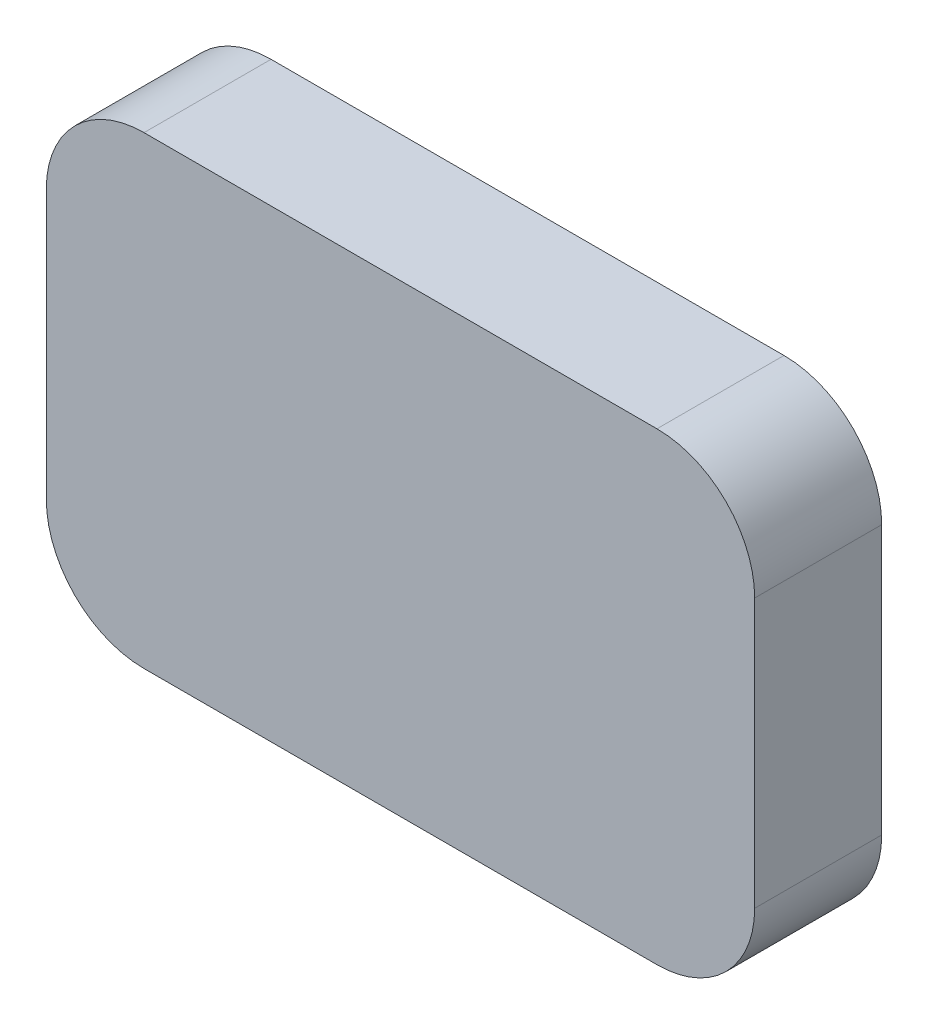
ISO-10303-21;
HEADER;
FILE_DESCRIPTION(('STEP AP214'),'2;1');
FILE_NAME('part.step','',(''),(''),'','','');
FILE_SCHEMA(('AUTOMOTIVE_DESIGN { 1 0 10303 214 1 1 1 1 }'));
ENDSEC;
DATA;
#1=APPLICATION_CONTEXT('core data for automotive mechanical design processes');
#2=APPLICATION_PROTOCOL_DEFINITION('international standard','automotive_design',2000,#1);
#3=PRODUCT_CONTEXT('',#1,'mechanical');
#4=PRODUCT('Part','Part','',(#3));
#5=PRODUCT_RELATED_PRODUCT_CATEGORY('part','',(#4));
#6=PRODUCT_DEFINITION_FORMATION('','',#4);
#7=PRODUCT_DEFINITION_CONTEXT('part definition',#1,'design');
#8=PRODUCT_DEFINITION('design','',#6,#7);
#9=PRODUCT_DEFINITION_SHAPE('','',#8);
#10=(LENGTH_UNIT() NAMED_UNIT(*) SI_UNIT(.MILLI.,.METRE.));
#11=(NAMED_UNIT(*) PLANE_ANGLE_UNIT() SI_UNIT($,.RADIAN.));
#12=(NAMED_UNIT(*) SI_UNIT($,.STERADIAN.) SOLID_ANGLE_UNIT());
#13=UNCERTAINTY_MEASURE_WITH_UNIT(LENGTH_MEASURE(1.E-05),#10,'distance_accuracy_value','');
#14=(GEOMETRIC_REPRESENTATION_CONTEXT(3) GLOBAL_UNCERTAINTY_ASSIGNED_CONTEXT((#13)) GLOBAL_UNIT_ASSIGNED_CONTEXT((#10,
#11,#12)) REPRESENTATION_CONTEXT('',''));
#15=CARTESIAN_POINT('',(0.,0.,0.));
#16=DIRECTION('',(0.,0.,1.));
#17=DIRECTION('',(1.,0.,0.));
#18=AXIS2_PLACEMENT_3D('',#15,#16,#17);
#19=CARTESIAN_POINT('',(20.,75.,26.));
#20=DIRECTION('',(0.,0.,-1.));
#21=DIRECTION('',(-1.,0.,0.));
#22=AXIS2_PLACEMENT_3D('',#19,#20,#21);
#23=CYLINDRICAL_SURFACE('',#22,20.);
#24=CARTESIAN_POINT('',(20.,75.,0.));
#25=DIRECTION('',(0.,0.,1.));
#26=DIRECTION('',(-1.,0.,0.));
#27=AXIS2_PLACEMENT_3D('',#24,#25,#26);
#28=CIRCLE('',#27,20.);
#29=CARTESIAN_POINT('',(20.0000000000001,95.,0.));
#30=VERTEX_POINT('',#29);
#31=CARTESIAN_POINT('',(0.,74.9999999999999,0.));
#32=VERTEX_POINT('',#31);
#33=EDGE_CURVE('E131',#30,#32,#28,.T.);
#34=ORIENTED_EDGE('',*,*,#33,.T.);
#35=DIRECTION('',(0.,0.,-1.));
#36=VECTOR('',#35,1.);
#37=CARTESIAN_POINT('',(0.,74.9999999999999,26.));
#38=LINE('',#37,#36);
#39=CARTESIAN_POINT('',(0.,74.9999999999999,26.));
#40=VERTEX_POINT('',#39);
#41=EDGE_CURVE('E11',#40,#32,#38,.T.);
#42=ORIENTED_EDGE('',*,*,#41,.F.);
#43=CARTESIAN_POINT('',(20.,75.,26.));
#44=DIRECTION('',(0.,0.,1.));
#45=DIRECTION('',(-1.,0.,0.));
#46=AXIS2_PLACEMENT_3D('',#43,#44,#45);
#47=CIRCLE('',#46,20.);
#48=CARTESIAN_POINT('',(20.0000000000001,95.,26.));
#49=VERTEX_POINT('',#48);
#50=EDGE_CURVE('E145',#49,#40,#47,.T.);
#51=ORIENTED_EDGE('',*,*,#50,.F.);
#52=DIRECTION('',(0.,0.,-1.));
#53=VECTOR('',#52,1.);
#54=CARTESIAN_POINT('',(20.0000000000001,95.,26.));
#55=LINE('',#54,#53);
#56=EDGE_CURVE('E127',#49,#30,#55,.T.);
#57=ORIENTED_EDGE('',*,*,#56,.T.);
#58=EDGE_LOOP('',(#34,#42,#51,#57));
#59=FACE_BOUND('',#58,.T.);
#60=ADVANCED_FACE('F35',(#59),#23,.T.);
#61=CARTESIAN_POINT('',(0.,20.0000000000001,26.));
#62=DIRECTION('',(1.,0.,0.));
#63=DIRECTION('',(0.,1.,0.));
#64=AXIS2_PLACEMENT_3D('',#61,#62,#63);
#65=PLANE('',#64);
#66=DIRECTION('',(0.,-1.,0.));
#67=VECTOR('',#66,1.);
#68=CARTESIAN_POINT('',(0.,20.0000000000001,0.));
#69=LINE('',#68,#67);
#70=CARTESIAN_POINT('',(0.,20.0000000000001,0.));
#71=VERTEX_POINT('',#70);
#72=EDGE_CURVE('E134',#32,#71,#69,.T.);
#73=ORIENTED_EDGE('',*,*,#72,.T.);
#74=DIRECTION('',(0.,0.,-1.));
#75=VECTOR('',#74,1.);
#76=CARTESIAN_POINT('',(0.,20.0000000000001,26.));
#77=LINE('',#76,#75);
#78=CARTESIAN_POINT('',(0.,20.0000000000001,26.));
#79=VERTEX_POINT('',#78);
#80=EDGE_CURVE('E43',#79,#71,#77,.T.);
#81=ORIENTED_EDGE('',*,*,#80,.F.);
#82=DIRECTION('',(0.,-1.,0.));
#83=VECTOR('',#82,1.);
#84=CARTESIAN_POINT('',(0.,20.0000000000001,26.));
#85=LINE('',#84,#83);
#86=EDGE_CURVE('E94',#40,#79,#85,.T.);
#87=ORIENTED_EDGE('',*,*,#86,.F.);
#88=ORIENTED_EDGE('',*,*,#41,.T.);
#89=EDGE_LOOP('',(#73,#81,#87,#88));
#90=FACE_BOUND('',#89,.T.);
#91=ADVANCED_FACE('F180',(#90),#65,.F.);
#92=CARTESIAN_POINT('',(20.,20.,26.));
#93=DIRECTION('',(0.,0.,-1.));
#94=DIRECTION('',(-1.,0.,0.));
#95=AXIS2_PLACEMENT_3D('',#92,#93,#94);
#96=CYLINDRICAL_SURFACE('',#95,20.);
#97=CARTESIAN_POINT('',(20.,20.,0.));
#98=DIRECTION('',(0.,0.,1.));
#99=DIRECTION('',(-1.,0.,0.));
#100=AXIS2_PLACEMENT_3D('',#97,#98,#99);
#101=CIRCLE('',#100,20.);
#102=CARTESIAN_POINT('',(20.0000000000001,0.,0.));
#103=VERTEX_POINT('',#102);
#104=EDGE_CURVE('E136',#71,#103,#101,.T.);
#105=ORIENTED_EDGE('',*,*,#104,.T.);
#106=DIRECTION('',(0.,0.,-1.));
#107=VECTOR('',#106,1.);
#108=CARTESIAN_POINT('',(20.0000000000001,0.,26.));
#109=LINE('',#108,#107);
#110=CARTESIAN_POINT('',(20.0000000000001,0.,26.));
#111=VERTEX_POINT('',#110);
#112=EDGE_CURVE('E152',#111,#103,#109,.T.);
#113=ORIENTED_EDGE('',*,*,#112,.F.);
#114=CARTESIAN_POINT('',(20.,20.,26.));
#115=DIRECTION('',(0.,0.,1.));
#116=DIRECTION('',(-1.,0.,0.));
#117=AXIS2_PLACEMENT_3D('',#114,#115,#116);
#118=CIRCLE('',#117,20.);
#119=EDGE_CURVE('E160',#79,#111,#118,.T.);
#120=ORIENTED_EDGE('',*,*,#119,.F.);
#121=ORIENTED_EDGE('',*,*,#80,.T.);
#122=EDGE_LOOP('',(#105,#113,#120,#121));
#123=FACE_BOUND('',#122,.T.);
#124=ADVANCED_FACE('F158',(#123),#96,.T.);
#125=CARTESIAN_POINT('',(20.0000000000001,0.,26.));
#126=DIRECTION('',(0.,1.,0.));
#127=DIRECTION('',(0.,0.,1.));
#128=AXIS2_PLACEMENT_3D('',#125,#126,#127);
#129=PLANE('',#128);
#130=DIRECTION('',(1.,0.,0.));
#131=VECTOR('',#130,1.);
#132=CARTESIAN_POINT('',(20.0000000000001,0.,0.));
#133=LINE('',#132,#131);
#134=CARTESIAN_POINT('',(125.,0.,0.));
#135=VERTEX_POINT('',#134);
#136=EDGE_CURVE('E138',#103,#135,#133,.T.);
#137=ORIENTED_EDGE('',*,*,#136,.T.);
#138=DIRECTION('',(0.,0.,-1.));
#139=VECTOR('',#138,1.);
#140=CARTESIAN_POINT('',(125.,0.,26.));
#141=LINE('',#140,#139);
#142=CARTESIAN_POINT('',(125.,0.,26.));
#143=VERTEX_POINT('',#142);
#144=EDGE_CURVE('E149',#143,#135,#141,.T.);
#145=ORIENTED_EDGE('',*,*,#144,.F.);
#146=DIRECTION('',(1.,0.,0.));
#147=VECTOR('',#146,1.);
#148=CARTESIAN_POINT('',(20.0000000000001,0.,26.));
#149=LINE('',#148,#147);
#150=EDGE_CURVE('E172',#111,#143,#149,.T.);
#151=ORIENTED_EDGE('',*,*,#150,.F.);
#152=ORIENTED_EDGE('',*,*,#112,.T.);
#153=EDGE_LOOP('',(#137,#145,#151,#152));
#154=FACE_BOUND('',#153,.T.);
#155=ADVANCED_FACE('F168',(#154),#129,.F.);
#156=CARTESIAN_POINT('',(125.,20.,26.));
#157=DIRECTION('',(0.,0.,-1.));
#158=DIRECTION('',(-1.,0.,0.));
#159=AXIS2_PLACEMENT_3D('',#156,#157,#158);
#160=CYLINDRICAL_SURFACE('',#159,20.);
#161=CARTESIAN_POINT('',(125.,20.,0.));
#162=DIRECTION('',(0.,0.,1.));
#163=DIRECTION('',(-1.,0.,0.));
#164=AXIS2_PLACEMENT_3D('',#161,#162,#163);
#165=CIRCLE('',#164,20.);
#166=CARTESIAN_POINT('',(145.,20.0000000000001,0.));
#167=VERTEX_POINT('',#166);
#168=EDGE_CURVE('E140',#135,#167,#165,.T.);
#169=ORIENTED_EDGE('',*,*,#168,.T.);
#170=DIRECTION('',(0.,0.,-1.));
#171=VECTOR('',#170,1.);
#172=CARTESIAN_POINT('',(145.,20.0000000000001,26.));
#173=LINE('',#172,#171);
#174=CARTESIAN_POINT('',(145.,20.0000000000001,26.));
#175=VERTEX_POINT('',#174);
#176=EDGE_CURVE('E122',#175,#167,#173,.T.);
#177=ORIENTED_EDGE('',*,*,#176,.F.);
#178=CARTESIAN_POINT('',(125.,20.,26.));
#179=DIRECTION('',(0.,0.,1.));
#180=DIRECTION('',(-1.,0.,0.));
#181=AXIS2_PLACEMENT_3D('',#178,#179,#180);
#182=CIRCLE('',#181,20.);
#183=EDGE_CURVE('E113',#143,#175,#182,.T.);
#184=ORIENTED_EDGE('',*,*,#183,.F.);
#185=ORIENTED_EDGE('',*,*,#144,.T.);
#186=EDGE_LOOP('',(#169,#177,#184,#185));
#187=FACE_BOUND('',#186,.T.);
#188=ADVANCED_FACE('F171',(#187),#160,.T.);
#189=CARTESIAN_POINT('',(145.,20.0000000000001,26.));
#190=DIRECTION('',(-1.,0.,0.));
#191=DIRECTION('',(0.,-1.,0.));
#192=AXIS2_PLACEMENT_3D('',#189,#190,#191);
#193=PLANE('',#192);
#194=DIRECTION('',(0.,1.,0.));
#195=VECTOR('',#194,1.);
#196=CARTESIAN_POINT('',(145.,20.0000000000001,0.));
#197=LINE('',#196,#195);
#198=CARTESIAN_POINT('',(145.,74.9999999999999,0.));
#199=VERTEX_POINT('',#198);
#200=EDGE_CURVE('E121',#167,#199,#197,.T.);
#201=ORIENTED_EDGE('',*,*,#200,.T.);
#202=DIRECTION('',(0.,0.,-1.));
#203=VECTOR('',#202,1.);
#204=CARTESIAN_POINT('',(145.,74.9999999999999,26.));
#205=LINE('',#204,#203);
#206=CARTESIAN_POINT('',(145.,74.9999999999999,26.));
#207=VERTEX_POINT('',#206);
#208=EDGE_CURVE('E118',#207,#199,#205,.T.);
#209=ORIENTED_EDGE('',*,*,#208,.F.);
#210=DIRECTION('',(0.,1.,0.));
#211=VECTOR('',#210,1.);
#212=CARTESIAN_POINT('',(145.,20.0000000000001,26.));
#213=LINE('',#212,#211);
#214=EDGE_CURVE('E107',#175,#207,#213,.T.);
#215=ORIENTED_EDGE('',*,*,#214,.F.);
#216=ORIENTED_EDGE('',*,*,#176,.T.);
#217=EDGE_LOOP('',(#201,#209,#215,#216));
#218=FACE_BOUND('',#217,.T.);
#219=ADVANCED_FACE('F119',(#218),#193,.F.);
#220=CARTESIAN_POINT('',(125.,75.,26.));
#221=DIRECTION('',(0.,0.,-1.));
#222=DIRECTION('',(-1.,0.,0.));
#223=AXIS2_PLACEMENT_3D('',#220,#221,#222);
#224=CYLINDRICAL_SURFACE('',#223,20.);
#225=CARTESIAN_POINT('',(125.,75.,0.));
#226=DIRECTION('',(0.,0.,1.));
#227=DIRECTION('',(-1.,0.,0.));
#228=AXIS2_PLACEMENT_3D('',#225,#226,#227);
#229=CIRCLE('',#228,20.);
#230=CARTESIAN_POINT('',(125.,95.,0.));
#231=VERTEX_POINT('',#230);
#232=EDGE_CURVE('E80',#199,#231,#229,.T.);
#233=ORIENTED_EDGE('',*,*,#232,.T.);
#234=DIRECTION('',(0.,0.,-1.));
#235=VECTOR('',#234,1.);
#236=CARTESIAN_POINT('',(125.,95.,26.));
#237=LINE('',#236,#235);
#238=CARTESIAN_POINT('',(125.,95.,26.));
#239=VERTEX_POINT('',#238);
#240=EDGE_CURVE('E123',#239,#231,#237,.T.);
#241=ORIENTED_EDGE('',*,*,#240,.F.);
#242=CARTESIAN_POINT('',(125.,75.,26.));
#243=DIRECTION('',(0.,0.,1.));
#244=DIRECTION('',(-1.,0.,0.));
#245=AXIS2_PLACEMENT_3D('',#242,#243,#244);
#246=CIRCLE('',#245,20.);
#247=EDGE_CURVE('E111',#207,#239,#246,.T.);
#248=ORIENTED_EDGE('',*,*,#247,.F.);
#249=ORIENTED_EDGE('',*,*,#208,.T.);
#250=EDGE_LOOP('',(#233,#241,#248,#249));
#251=FACE_BOUND('',#250,.T.);
#252=ADVANCED_FACE('F125',(#251),#224,.T.);
#253=CARTESIAN_POINT('',(20.0000000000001,95.,26.));
#254=DIRECTION('',(0.,-1.,0.));
#255=DIRECTION('',(0.,0.,-1.));
#256=AXIS2_PLACEMENT_3D('',#253,#254,#255);
#257=PLANE('',#256);
#258=DIRECTION('',(-1.,0.,0.));
#259=VECTOR('',#258,1.);
#260=CARTESIAN_POINT('',(20.0000000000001,95.,0.));
#261=LINE('',#260,#259);
#262=EDGE_CURVE('E86',#231,#30,#261,.T.);
#263=ORIENTED_EDGE('',*,*,#262,.T.);
#264=ORIENTED_EDGE('',*,*,#56,.F.);
#265=DIRECTION('',(-1.,0.,0.));
#266=VECTOR('',#265,1.);
#267=CARTESIAN_POINT('',(20.0000000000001,95.,26.));
#268=LINE('',#267,#266);
#269=EDGE_CURVE('E51',#239,#49,#268,.T.);
#270=ORIENTED_EDGE('',*,*,#269,.F.);
#271=ORIENTED_EDGE('',*,*,#240,.T.);
#272=EDGE_LOOP('',(#263,#264,#270,#271));
#273=FACE_BOUND('',#272,.T.);
#274=ADVANCED_FACE('F196',(#273),#257,.F.);
#275=CARTESIAN_POINT('',(20.,75.,26.));
#276=DIRECTION('',(0.,0.,-1.));
#277=DIRECTION('',(-1.,0.,0.));
#278=AXIS2_PLACEMENT_3D('',#275,#276,#277);
#279=PLANE('',#278);
#280=ORIENTED_EDGE('',*,*,#50,.T.);
#281=ORIENTED_EDGE('',*,*,#86,.T.);
#282=ORIENTED_EDGE('',*,*,#119,.T.);
#283=ORIENTED_EDGE('',*,*,#150,.T.);
#284=ORIENTED_EDGE('',*,*,#183,.T.);
#285=ORIENTED_EDGE('',*,*,#214,.T.);
#286=ORIENTED_EDGE('',*,*,#247,.T.);
#287=ORIENTED_EDGE('',*,*,#269,.T.);
#288=EDGE_LOOP('',(#280,#281,#282,#283,#284,#285,#286,#287));
#289=FACE_BOUND('',#288,.T.);
#290=ADVANCED_FACE('F109',(#289),#279,.F.);
#291=CARTESIAN_POINT('',(20.,75.,0.));
#292=DIRECTION('',(0.,0.,-1.));
#293=DIRECTION('',(-1.,0.,0.));
#294=AXIS2_PLACEMENT_3D('',#291,#292,#293);
#295=PLANE('',#294);
#296=ORIENTED_EDGE('',*,*,#33,.F.);
#297=ORIENTED_EDGE('',*,*,#262,.F.);
#298=ORIENTED_EDGE('',*,*,#232,.F.);
#299=ORIENTED_EDGE('',*,*,#200,.F.);
#300=ORIENTED_EDGE('',*,*,#168,.F.);
#301=ORIENTED_EDGE('',*,*,#136,.F.);
#302=ORIENTED_EDGE('',*,*,#104,.F.);
#303=ORIENTED_EDGE('',*,*,#72,.F.);
#304=EDGE_LOOP('',(#296,#297,#298,#299,#300,#301,#302,#303));
#305=FACE_BOUND('',#304,.T.);
#306=ADVANCED_FACE('F164',(#305),#295,.T.);
#307=CLOSED_SHELL('',(#60,#91,#124,#155,#188,#219,#252,#274,#290,#306));
#308=MANIFOLD_SOLID_BREP('B2',#307);
#309=ADVANCED_BREP_SHAPE_REPRESENTATION('',(#18,#308),#14);
#310=SHAPE_DEFINITION_REPRESENTATION(#9,#309);
ENDSEC;
END-ISO-10303-21;
